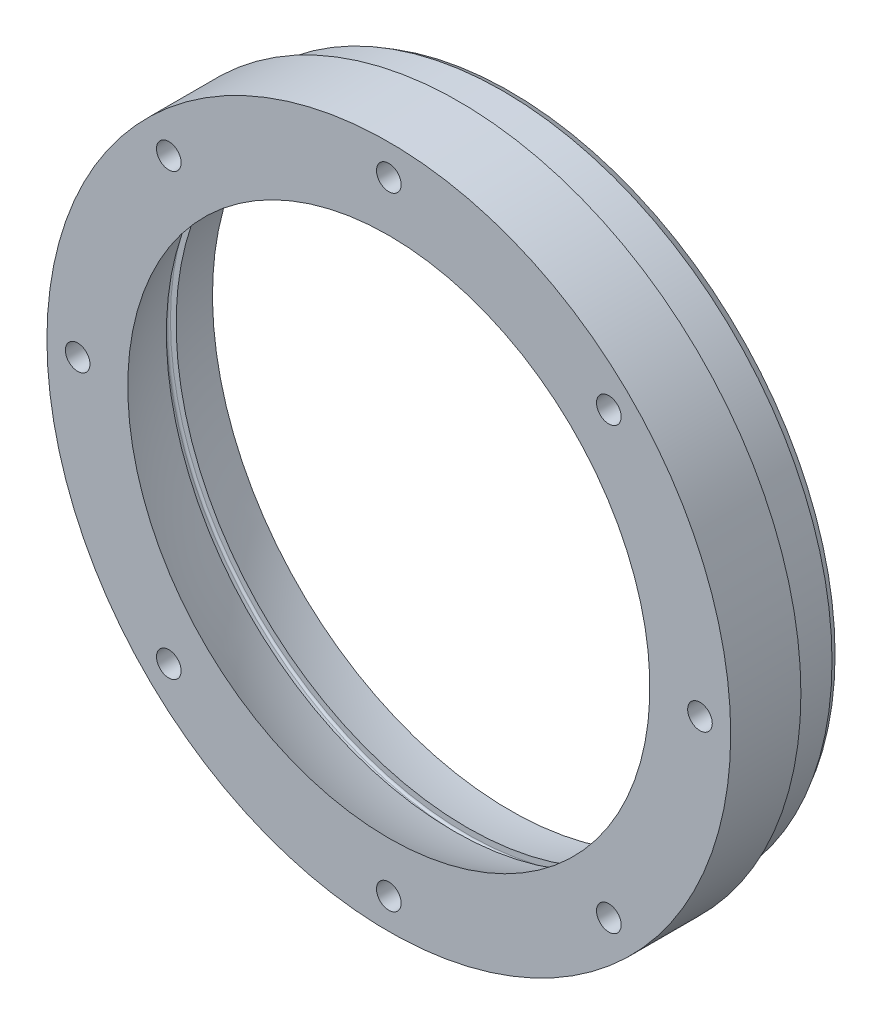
from build123d import *

# Parameters (mm, degrees)
R_P_TITION_CIRCULAIRE1_COUNT = 8
ESQUISSE4_R                  = 82.6
ESQUISSE4_R_2                = 64.322612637
EXTRUSION1_DEPTH             = 3.6
CONG_1_R                     = 0.6


with BuildPart() as part:
    # Esquisse1 → R_volution1 (revolve)
    with BuildSketch(Plane(origin=(0, 0, 0), x_dir=(0, 0, -1), z_dir=(1, 0, 0)), mode=Mode.PRIVATE) as r_volution1_sk:
        with BuildLine():
            Line((0, 94.5), (19.4, 94.5))
            Line((19.4, 94.5), (19.4, 91))
            Line((19.4, 91), (31.5, 91))
            Line((31.5, 91), (33.5, 89.845299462))
            Line((33.5, 89.845299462), (33.5, 82.24354078))
            ThreePointArc((33.5, 82.24354078), (16.209025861, 78.995186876), (0, 72.154348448))
            Line((0, 72.154348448), (0, 94.5))
        make_face()
    revolve(r_volution1_sk.sketch.rotate(Axis((0, 0, 0), (0, 0, -1)), 90), axis=Axis((0, 0, 0), (0, 0, -1)))

    # Esquisse3 → Trou taraud_ M81 (revolve, cut)
    with BuildSketch(Plane(origin=(0, 86, 0), x_dir=(0, -1, 0), z_dir=(1, 0, 0))):
        Polygon((0, 0), (0, 12.542926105), (3.4, 10.5), (3.4, 0), align=None)
    trou_taraud_m81 = revolve(axis=Axis((0, 86, 6.35), (0, 0, -1)), mode=Mode.SUBTRACT)

    # R_p_tition circulaire1: Trou taraud_ M81 ×8 about axis
    r_p_tition_circulaire1_axis = Axis((0, 0, 0), (0, 0, 1))
    for i in range(1, R_P_TITION_CIRCULAIRE1_COUNT):
        add(trou_taraud_m81.rotate(r_p_tition_circulaire1_axis, i * 360 / R_P_TITION_CIRCULAIRE1_COUNT), mode=Mode.SUBTRACT)

    # Esquisse4 → Extrusion1 (cut)
    with BuildSketch(Plane(origin=(0, 0, -21.64), x_dir=(-1, 0, 0), z_dir=(0, 0, -1))):
        Circle(ESQUISSE4_R)
        Circle(ESQUISSE4_R_2, mode=Mode.SUBTRACT)
    extrude(amount=-EXTRUSION1_DEPTH, mode=Mode.SUBTRACT)

    # Cong_1
    cong_1_edges = [part.edges().sort_by_distance(p)[0] for p in [
        (82.6, 0, -21.64),
        (82.6, 0, -18.04),
    ]]
    fillet(cong_1_edges, radius=CONG_1_R)


solid = part.part
